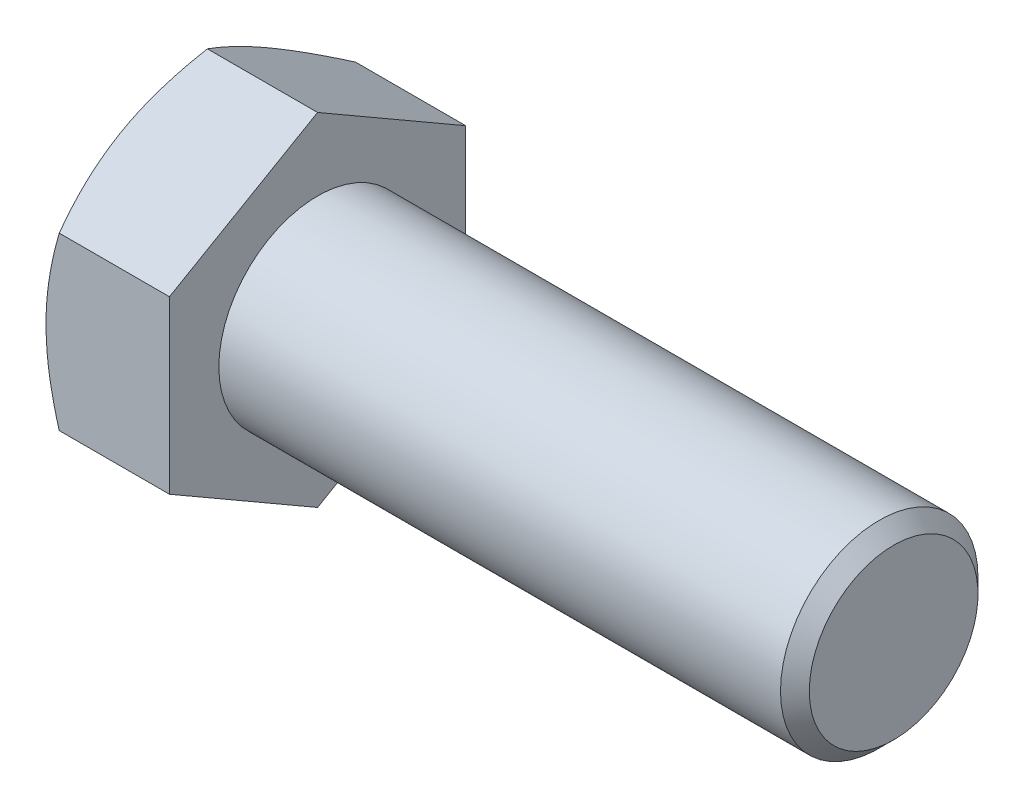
ISO-10303-21;
HEADER;
FILE_DESCRIPTION(('STEP AP214'),'2;1');
FILE_NAME('part.step','',(''),(''),'','','');
FILE_SCHEMA(('AUTOMOTIVE_DESIGN { 1 0 10303 214 1 1 1 1 }'));
ENDSEC;
DATA;
#1=APPLICATION_CONTEXT('core data for automotive mechanical design processes');
#2=APPLICATION_PROTOCOL_DEFINITION('international standard','automotive_design',2000,#1);
#3=PRODUCT_CONTEXT('',#1,'mechanical');
#4=PRODUCT('Part','Part','',(#3));
#5=PRODUCT_RELATED_PRODUCT_CATEGORY('part','',(#4));
#6=PRODUCT_DEFINITION_FORMATION('','',#4);
#7=PRODUCT_DEFINITION_CONTEXT('part definition',#1,'design');
#8=PRODUCT_DEFINITION('design','',#6,#7);
#9=PRODUCT_DEFINITION_SHAPE('','',#8);
#10=(LENGTH_UNIT() NAMED_UNIT(*) SI_UNIT(.MILLI.,.METRE.));
#11=(NAMED_UNIT(*) PLANE_ANGLE_UNIT() SI_UNIT($,.RADIAN.));
#12=(NAMED_UNIT(*) SI_UNIT($,.STERADIAN.) SOLID_ANGLE_UNIT());
#13=UNCERTAINTY_MEASURE_WITH_UNIT(LENGTH_MEASURE(1.E-05),#10,'distance_accuracy_value','');
#14=(GEOMETRIC_REPRESENTATION_CONTEXT(3) GLOBAL_UNCERTAINTY_ASSIGNED_CONTEXT((#13)) GLOBAL_UNIT_ASSIGNED_CONTEXT((#10,
#11,#12)) REPRESENTATION_CONTEXT('',''));
#15=CARTESIAN_POINT('',(0.,0.,0.));
#16=DIRECTION('',(0.,0.,1.));
#17=DIRECTION('',(1.,0.,0.));
#18=AXIS2_PLACEMENT_3D('',#15,#16,#17);
#19=CARTESIAN_POINT('',(35.,-2.42861286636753E-13,1.38777878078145E-13));
#20=DIRECTION('',(-0.999999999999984,0.,0.));
#21=DIRECTION('',(0.,0.,0.999999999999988));
#22=AXIS2_PLACEMENT_3D('',#19,#20,#21);
#23=CYLINDRICAL_SURFACE('',#22,6.);
#24=CARTESIAN_POINT('',(34.125,-1.80411241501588E-13,3.60822483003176E-13));
#25=DIRECTION('',(0.999999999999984,0.,0.));
#26=DIRECTION('',(0.,0.,-0.999999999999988));
#27=AXIS2_PLACEMENT_3D('',#24,#25,#26);
#28=CIRCLE('',#27,6.);
#29=CARTESIAN_POINT('',(34.125,-2.26207941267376E-13,6.00000000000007));
#30=VERTEX_POINT('',#29);
#31=EDGE_CURVE('E11',#30,#30,#28,.F.);
#32=CARTESIAN_POINT('',(0.,0.,0.));
#33=DIRECTION('',(-0.999999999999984,0.,0.));
#34=DIRECTION('',(0.,0.,0.999999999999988));
#35=AXIS2_PLACEMENT_3D('',#32,#33,#34);
#36=CIRCLE('',#35,6.);
#37=CARTESIAN_POINT('',(0.,-2.26207941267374E-13,6.00000000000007));
#38=VERTEX_POINT('',#37);
#39=EDGE_CURVE('E209',#38,#38,#36,.T.);
#40=CARTESIAN_POINT('',(34.125,-2.26207941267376E-13,6.00000000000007));
#41=CARTESIAN_POINT('',(33.76953125,-2.26207941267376E-13,6.00000000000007));
#42=CARTESIAN_POINT('',(33.4140625,-2.26207941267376E-13,6.00000000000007));
#43=CARTESIAN_POINT('',(32.703125,-2.26207941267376E-13,6.00000000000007));
#44=CARTESIAN_POINT('',(32.34765625,-2.26207941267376E-13,6.00000000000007));
#45=CARTESIAN_POINT('',(31.63671875,-2.26207941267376E-13,6.00000000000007));
#46=CARTESIAN_POINT('',(31.28125,-2.26207941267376E-13,6.00000000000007));
#47=CARTESIAN_POINT('',(30.5703125,-2.26207941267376E-13,6.00000000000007));
#48=CARTESIAN_POINT('',(30.21484375,-2.26207941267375E-13,6.00000000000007));
#49=CARTESIAN_POINT('',(29.50390625,-2.26207941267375E-13,6.00000000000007));
#50=CARTESIAN_POINT('',(29.1484375,-2.26207941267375E-13,6.00000000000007));
#51=CARTESIAN_POINT('',(28.4375,-2.26207941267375E-13,6.00000000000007));
#52=CARTESIAN_POINT('',(28.08203125,-2.26207941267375E-13,6.00000000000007));
#53=CARTESIAN_POINT('',(27.37109375,-2.26207941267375E-13,6.00000000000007));
#54=CARTESIAN_POINT('',(27.015625,-2.26207941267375E-13,6.00000000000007));
#55=CARTESIAN_POINT('',(26.3046875,-2.26207941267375E-13,6.00000000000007));
#56=CARTESIAN_POINT('',(25.94921875,-2.26207941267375E-13,6.00000000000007));
#57=CARTESIAN_POINT('',(25.23828125,-2.26207941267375E-13,6.00000000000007));
#58=CARTESIAN_POINT('',(24.8828125,-2.26207941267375E-13,6.00000000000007));
#59=CARTESIAN_POINT('',(24.171875,-2.26207941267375E-13,6.00000000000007));
#60=CARTESIAN_POINT('',(23.81640625,-2.26207941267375E-13,6.00000000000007));
#61=CARTESIAN_POINT('',(23.10546875,-2.26207941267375E-13,6.00000000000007));
#62=CARTESIAN_POINT('',(22.75,-2.26207941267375E-13,6.00000000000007));
#63=CARTESIAN_POINT('',(22.0390625,-2.26207941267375E-13,6.00000000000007));
#64=CARTESIAN_POINT('',(21.68359375,-2.26207941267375E-13,6.00000000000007));
#65=CARTESIAN_POINT('',(20.97265625,-2.26207941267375E-13,6.00000000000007));
#66=CARTESIAN_POINT('',(20.6171875,-2.26207941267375E-13,6.00000000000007));
#67=CARTESIAN_POINT('',(19.90625,-2.26207941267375E-13,6.00000000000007));
#68=CARTESIAN_POINT('',(19.55078125,-2.26207941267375E-13,6.00000000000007));
#69=CARTESIAN_POINT('',(18.83984375,-2.26207941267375E-13,6.00000000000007));
#70=CARTESIAN_POINT('',(18.484375,-2.26207941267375E-13,6.00000000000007));
#71=CARTESIAN_POINT('',(17.7734375,-2.26207941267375E-13,6.00000000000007));
#72=CARTESIAN_POINT('',(17.41796875,-2.26207941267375E-13,6.00000000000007));
#73=CARTESIAN_POINT('',(16.70703125,-2.26207941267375E-13,6.00000000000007));
#74=CARTESIAN_POINT('',(16.3515625,-2.26207941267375E-13,6.00000000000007));
#75=CARTESIAN_POINT('',(15.640625,-2.26207941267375E-13,6.00000000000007));
#76=CARTESIAN_POINT('',(15.28515625,-2.26207941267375E-13,6.00000000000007));
#77=CARTESIAN_POINT('',(14.57421875,-2.26207941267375E-13,6.00000000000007));
#78=CARTESIAN_POINT('',(14.21875,-2.26207941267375E-13,6.00000000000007));
#79=CARTESIAN_POINT('',(13.5078125,-2.26207941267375E-13,6.00000000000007));
#80=CARTESIAN_POINT('',(13.15234375,-2.26207941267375E-13,6.00000000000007));
#81=CARTESIAN_POINT('',(12.44140625,-2.26207941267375E-13,6.00000000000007));
#82=CARTESIAN_POINT('',(12.0859375,-2.26207941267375E-13,6.00000000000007));
#83=CARTESIAN_POINT('',(11.375,-2.26207941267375E-13,6.00000000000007));
#84=CARTESIAN_POINT('',(11.01953125,-2.26207941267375E-13,6.00000000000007));
#85=CARTESIAN_POINT('',(10.30859375,-2.26207941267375E-13,6.00000000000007));
#86=CARTESIAN_POINT('',(9.95312499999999,-2.26207941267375E-13,6.00000000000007));
#87=CARTESIAN_POINT('',(9.24218749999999,-2.26207941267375E-13,6.00000000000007));
#88=CARTESIAN_POINT('',(8.88671874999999,-2.26207941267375E-13,6.00000000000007));
#89=CARTESIAN_POINT('',(8.17578124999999,-2.26207941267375E-13,6.00000000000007));
#90=CARTESIAN_POINT('',(7.82031249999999,-2.26207941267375E-13,6.00000000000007));
#91=CARTESIAN_POINT('',(7.10937499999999,-2.26207941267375E-13,6.00000000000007));
#92=CARTESIAN_POINT('',(6.75390624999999,-2.26207941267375E-13,6.00000000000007));
#93=CARTESIAN_POINT('',(6.04296874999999,-2.26207941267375E-13,6.00000000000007));
#94=CARTESIAN_POINT('',(5.68749999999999,-2.26207941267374E-13,6.00000000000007));
#95=CARTESIAN_POINT('',(4.97656249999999,-2.26207941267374E-13,6.00000000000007));
#96=CARTESIAN_POINT('',(4.62109374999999,-2.26207941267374E-13,6.00000000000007));
#97=CARTESIAN_POINT('',(3.91015624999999,-2.26207941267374E-13,6.00000000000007));
#98=CARTESIAN_POINT('',(3.55468749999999,-2.26207941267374E-13,6.00000000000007));
#99=CARTESIAN_POINT('',(2.84374999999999,-2.26207941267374E-13,6.00000000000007));
#100=CARTESIAN_POINT('',(2.48828124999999,-2.26207941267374E-13,6.00000000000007));
#101=CARTESIAN_POINT('',(1.77734374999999,-2.26207941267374E-13,6.00000000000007));
#102=CARTESIAN_POINT('',(1.42187499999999,-2.26207941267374E-13,6.00000000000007));
#103=CARTESIAN_POINT('',(0.710937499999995,-2.26207941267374E-13,6.00000000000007));
#104=CARTESIAN_POINT('',(0.355468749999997,-2.26207941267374E-13,6.00000000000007));
#105=CARTESIAN_POINT('',(0.,-2.26207941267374E-13,6.00000000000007));
#106=B_SPLINE_CURVE_WITH_KNOTS('',3,(#40,#41,#42,#43,#44,#45,#46,#47,#48,#49,#50,#51,#52,#53,
#54,#55,#56,#57,#58,#59,#60,#61,#62,#63,#64,#65,#66,#67,#68,#69,#70,#71,#72,#73,#74,#75,#76,#77,
#78,#79,#80,#81,#82,#83,#84,#85,#86,#87,#88,#89,#90,#91,#92,#93,#94,#95,#96,#97,#98,#99,#100,
#101,#102,#103,#104,#105),.UNSPECIFIED.,.F.,.F.,(4,2,2,2,2,2,2,2,2,2,2,2,2,2,2,2,2,2,2,2,2,2,2,
2,2,2,2,2,2,2,2,2,4),(0.,1.06640625,2.1328125,3.19921875,4.26562499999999,5.33203124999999,
6.3984375,7.46484374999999,8.53125,9.59765625,10.6640625,11.73046875,12.796875,13.86328125,
14.9296875,15.99609375,17.0625,18.12890625,19.1953125,20.26171875,21.328125,22.39453125,
23.4609375,24.52734375,25.59375,26.66015625,27.7265625,28.79296875,29.859375,30.92578125,
31.9921875,33.05859375,34.125),.UNSPECIFIED.);
#107=EDGE_CURVE('BSEAM35',#30,#38,#106,.T.);
#108=ORIENTED_EDGE('',*,*,#31,.T.);
#109=ORIENTED_EDGE('',*,*,#39,.F.);
#110=ORIENTED_EDGE('',*,*,#107,.T.);
#111=ORIENTED_EDGE('',*,*,#107,.F.);
#112=EDGE_LOOP('',(#108,#110,#109,#111));
#113=FACE_BOUND('',#112,.T.);
#114=ADVANCED_FACE('F35',(#113),#23,.T.);
#115=CARTESIAN_POINT('',(35.,-2.42861286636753E-13,1.38777878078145E-13));
#116=DIRECTION('',(0.999999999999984,0.,0.));
#117=DIRECTION('',(0.,0.,-0.999999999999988));
#118=AXIS2_PLACEMENT_3D('',#115,#116,#117);
#119=PLANE('',#118);
#120=CARTESIAN_POINT('',(35.,-2.42861286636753E-13,1.38777878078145E-13));
#121=DIRECTION('',(0.999999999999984,0.,0.));
#122=DIRECTION('',(0.,0.,-0.999999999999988));
#123=AXIS2_PLACEMENT_3D('',#120,#121,#122);
#124=CIRCLE('',#123,5.12499999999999);
#125=CARTESIAN_POINT('',(35.,-2.28636554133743E-13,5.12500000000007));
#126=VERTEX_POINT('',#125);
#127=EDGE_CURVE('E42',#126,#126,#124,.T.);
#128=ORIENTED_EDGE('',*,*,#127,.T.);
#129=EDGE_LOOP('',(#128));
#130=FACE_BOUND('',#129,.T.);
#131=ADVANCED_FACE('F195',(#130),#119,.T.);
#132=CARTESIAN_POINT('',(0.,-10.3923048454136,1.66533453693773E-13));
#133=DIRECTION('',(-0.999999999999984,0.,0.));
#134=DIRECTION('',(0.,0.,0.999999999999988));
#135=AXIS2_PLACEMENT_3D('',#132,#133,#134);
#136=PLANE('',#135);
#137=DIRECTION('',(0.,0.500000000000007,0.86602540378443));
#138=VECTOR('',#137,1.);
#139=CARTESIAN_POINT('',(0.,-10.3923048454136,1.66533453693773E-13));
#140=LINE('',#139,#138);
#141=CARTESIAN_POINT('',(0.,-10.3923048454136,1.66533453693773E-13));
#142=VERTEX_POINT('',#141);
#143=CARTESIAN_POINT('',(6.66133814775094E-13,-5.19615242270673,9.00000000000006));
#144=VERTEX_POINT('',#143);
#145=EDGE_CURVE('E236',#142,#144,#140,.T.);
#146=ORIENTED_EDGE('',*,*,#145,.F.);
#147=DIRECTION('',(0.,0.500000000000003,-0.866025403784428));
#148=VECTOR('',#147,1.);
#149=CARTESIAN_POINT('',(0.,-10.3923048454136,1.66533453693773E-13));
#150=LINE('',#149,#148);
#151=CARTESIAN_POINT('',(6.66133814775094E-13,-5.1961524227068,-8.99999999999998));
#152=VERTEX_POINT('',#151);
#153=EDGE_CURVE('E223',#142,#152,#150,.T.);
#154=ORIENTED_EDGE('',*,*,#153,.T.);
#155=DIRECTION('',(0.,1.00000000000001,0.));
#156=VECTOR('',#155,1.);
#157=CARTESIAN_POINT('',(6.66133814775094E-13,-5.1961524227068,-8.99999999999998));
#158=LINE('',#157,#156);
#159=CARTESIAN_POINT('',(-2.22044604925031E-13,5.19615242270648,-8.99999999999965));
#160=VERTEX_POINT('',#159);
#161=EDGE_CURVE('E226',#152,#160,#158,.T.);
#162=ORIENTED_EDGE('',*,*,#161,.T.);
#163=DIRECTION('',(0.,0.500000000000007,0.866025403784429));
#164=VECTOR('',#163,1.);
#165=CARTESIAN_POINT('',(-2.22044604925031E-13,5.19615242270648,-8.99999999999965));
#166=LINE('',#165,#164);
#167=CARTESIAN_POINT('',(0.,10.3923048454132,0.));
#168=VERTEX_POINT('',#167);
#169=EDGE_CURVE('E229',#160,#168,#166,.T.);
#170=ORIENTED_EDGE('',*,*,#169,.T.);
#171=DIRECTION('',(0.,0.500000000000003,-0.866025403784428));
#172=VECTOR('',#171,1.);
#173=CARTESIAN_POINT('',(-3.88578058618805E-13,5.19615242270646,8.99999999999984));
#174=LINE('',#173,#172);
#175=CARTESIAN_POINT('',(-3.88578058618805E-13,5.19615242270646,8.99999999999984));
#176=VERTEX_POINT('',#175);
#177=EDGE_CURVE('E232',#176,#168,#174,.T.);
#178=ORIENTED_EDGE('',*,*,#177,.F.);
#179=DIRECTION('',(0.,1.00000000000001,0.));
#180=VECTOR('',#179,1.);
#181=CARTESIAN_POINT('',(6.66133814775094E-13,-5.19615242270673,9.00000000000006));
#182=LINE('',#181,#180);
#183=EDGE_CURVE('E234',#144,#176,#182,.T.);
#184=ORIENTED_EDGE('',*,*,#183,.F.);
#185=EDGE_LOOP('',(#146,#154,#162,#170,#178,#184));
#186=FACE_BOUND('',#185,.T.);
#187=ORIENTED_EDGE('',*,*,#39,.T.);
#188=EDGE_LOOP('',(#187));
#189=FACE_BOUND('',#188,.T.);
#190=ADVANCED_FACE('F166',(#186,#189),#136,.F.);
#191=CARTESIAN_POINT('',(-7.50000000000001,-10.3923048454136,1.94289029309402E-13));
#192=DIRECTION('',(0.,0.866025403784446,-0.499999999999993));
#193=DIRECTION('',(0.,0.500000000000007,0.86602540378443));
#194=AXIS2_PLACEMENT_3D('',#191,#192,#193);
#195=PLANE('',#194);
#196=CARTESIAN_POINT('',(-6.69608575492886,-10.3924203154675,-0.000200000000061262));
#197=CARTESIAN_POINT('',(-6.76201799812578,-10.2782163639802,0.197607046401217));
#198=CARTESIAN_POINT('',(-6.82495859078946,-10.1635669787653,0.39618560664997));
#199=CARTESIAN_POINT('',(-6.94403100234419,-9.93333715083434,0.794955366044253));
#200=CARTESIAN_POINT('',(-7.00015988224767,-9.81775632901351,0.995147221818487));
#201=CARTESIAN_POINT('',(-7.10484803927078,-9.58544915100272,1.39751505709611));
#202=CARTESIAN_POINT('',(-7.15338922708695,-9.46872074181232,1.5996945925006));
#203=CARTESIAN_POINT('',(-7.2418514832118,-9.23447001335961,2.00542875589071));
#204=CARTESIAN_POINT('',(-7.28177431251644,-9.11694786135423,2.20898309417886));
#205=CARTESIAN_POINT('',(-7.35131532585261,-8.88408932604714,2.61230590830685));
#206=CARTESIAN_POINT('',(-7.38116249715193,-8.768770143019,2.81204459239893));
#207=CARTESIAN_POINT('',(-7.43120669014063,-8.53761579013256,3.2124156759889));
#208=CARTESIAN_POINT('',(-7.45140456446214,-8.42178066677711,3.4130479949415));
#209=CARTESIAN_POINT('',(-7.48164565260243,-8.18990950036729,3.81466063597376));
#210=CARTESIAN_POINT('',(-7.4917003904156,-8.07387383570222,4.01564030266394));
#211=CARTESIAN_POINT('',(-7.50143766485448,-7.84169571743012,4.41778459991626));
#212=CARTESIAN_POINT('',(-7.50112052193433,-7.72555326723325,4.61894922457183));
#213=CARTESIAN_POINT('',(-7.49083604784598,-7.50842142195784,4.99503261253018));
#214=CARTESIAN_POINT('',(-7.48212325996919,-7.40741671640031,5.16997789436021));
#215=CARTESIAN_POINT('',(-7.45702265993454,-7.20564389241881,5.51945867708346));
#216=CARTESIAN_POINT('',(-7.44063433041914,-7.10487579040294,5.69399414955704));
#217=CARTESIAN_POINT('',(-7.38034344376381,-6.80296159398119,6.21692487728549));
#218=CARTESIAN_POINT('',(-7.32532251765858,-6.60234990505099,6.56439451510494));
#219=CARTESIAN_POINT('',(-7.18776952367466,-6.19899850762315,7.26301962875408));
#220=CARTESIAN_POINT('',(-7.10465438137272,-5.99631027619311,7.61408594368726));
#221=CARTESIAN_POINT('',(-6.91601746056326,-5.5939563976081,8.3109833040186));
#222=CARTESIAN_POINT('',(-6.81053998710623,-5.39428559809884,8.65682327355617));
#223=CARTESIAN_POINT('',(-6.69608575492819,-5.19603695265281,9.00019999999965));
#224=B_SPLINE_CURVE_WITH_KNOTS('',3,(#196,#197,#198,#199,#200,#201,#202,#203,#204,#205,#206,
#207,#208,#209,#210,#211,#212,#213,#214,#215,#216,#217,#218,#219,#220,#221,#222,#223),
.UNSPECIFIED.,.F.,.F.,(4,2,2,2,2,2,2,2,2,2,2,2,2,4),(0.,0.713219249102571,1.42674513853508,
2.14194697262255,2.85700253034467,3.55449749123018,4.25193080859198,4.94857085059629,
5.64518936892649,6.25162976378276,6.85811104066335,8.0719374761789,9.31268391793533,
10.5509947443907),.UNSPECIFIED.);
#225=CARTESIAN_POINT('',(-6.6961524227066,-10.3923048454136,1.66533453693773E-13));
#226=VERTEX_POINT('',#225);
#227=CARTESIAN_POINT('',(-7.49999999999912,-7.79422863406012,4.49999999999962));
#228=VERTEX_POINT('',#227);
#229=EDGE_CURVE('E183',#226,#228,#224,.T.);
#230=ORIENTED_EDGE('',*,*,#229,.F.);
#231=DIRECTION('',(0.999999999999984,0.,0.));
#232=VECTOR('',#231,1.);
#233=CARTESIAN_POINT('',(-7.50000000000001,-10.3923048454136,1.94289029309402E-13));
#234=LINE('',#233,#232);
#235=EDGE_CURVE('E221',#226,#142,#234,.T.);
#236=ORIENTED_EDGE('',*,*,#235,.T.);
#237=ORIENTED_EDGE('',*,*,#145,.T.);
#238=DIRECTION('',(0.999999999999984,0.,0.));
#239=VECTOR('',#238,1.);
#240=CARTESIAN_POINT('',(-7.49999999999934,-5.19615242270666,8.99999999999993));
#241=LINE('',#240,#239);
#242=CARTESIAN_POINT('',(-6.69615242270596,-5.19615242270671,8.99999999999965));
#243=VERTEX_POINT('',#242);
#244=EDGE_CURVE('E212',#243,#144,#241,.T.);
#245=ORIENTED_EDGE('',*,*,#244,.F.);
#246=EDGE_CURVE('E137',#228,#243,#224,.T.);
#247=ORIENTED_EDGE('',*,*,#246,.F.);
#248=EDGE_LOOP('',(#230,#236,#237,#245,#247));
#249=FACE_BOUND('',#248,.T.);
#250=ADVANCED_FACE('F189',(#249),#195,.F.);
#251=CARTESIAN_POINT('',(-7.49999999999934,-5.19615242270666,8.99999999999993));
#252=DIRECTION('',(0.,0.,-0.999999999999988));
#253=DIRECTION('',(-0.999999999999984,0.,0.));
#254=AXIS2_PLACEMENT_3D('',#251,#252,#253);
#255=PLANE('',#254);
#256=CARTESIAN_POINT('',(-2.992817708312,-14.1938054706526,9.00000000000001));
#257=CARTESIAN_POINT('',(-3.18545400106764,-13.7986249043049,8.99999999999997));
#258=CARTESIAN_POINT('',(-3.37631016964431,-13.4025620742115,8.99999999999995));
#259=CARTESIAN_POINT('',(-3.75346543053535,-12.6082034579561,8.99999999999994));
#260=CARTESIAN_POINT('',(-3.93976384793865,-12.2099073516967,8.99999999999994));
#261=CARTESIAN_POINT('',(-4.30769386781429,-11.4086732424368,8.99999999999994));
#262=CARTESIAN_POINT('',(-4.48929651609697,-11.0057218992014,8.99999999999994));
#263=CARTESIAN_POINT('',(-4.84537774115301,-10.1966954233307,8.99999999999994));
#264=CARTESIAN_POINT('',(-5.01985663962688,-9.7906204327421,8.99999999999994));
#265=CARTESIAN_POINT('',(-5.36560228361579,-8.96081603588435,8.99999999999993));
#266=CARTESIAN_POINT('',(-5.53655757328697,-8.53695616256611,8.99999999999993));
#267=CARTESIAN_POINT('',(-5.86609252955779,-7.68436682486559,8.99999999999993));
#268=CARTESIAN_POINT('',(-6.02467084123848,-7.25563683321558,8.99999999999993));
#269=CARTESIAN_POINT('',(-6.32546141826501,-6.393348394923,8.99999999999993));
#270=CARTESIAN_POINT('',(-6.46770484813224,-5.95980093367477,8.99999999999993));
#271=CARTESIAN_POINT('',(-6.73142002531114,-5.08650675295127,8.99999999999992));
#272=CARTESIAN_POINT('',(-6.85289806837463,-4.64676195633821,8.9999999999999));
#273=CARTESIAN_POINT('',(-7.06875933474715,-3.76318857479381,8.9999999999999));
#274=CARTESIAN_POINT('',(-7.16329494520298,-3.31939822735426,8.99999999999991));
#275=CARTESIAN_POINT('',(-7.28091249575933,-2.64948950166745,8.99999999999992));
#276=CARTESIAN_POINT('',(-7.31608884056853,-2.42546830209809,8.99999999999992));
#277=CARTESIAN_POINT('',(-7.37769613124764,-1.97623392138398,8.99999999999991));
#278=CARTESIAN_POINT('',(-7.40412792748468,-1.75102085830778,8.99999999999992));
#279=CARTESIAN_POINT('',(-7.44737513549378,-1.30274989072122,8.99999999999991));
#280=CARTESIAN_POINT('',(-7.46431601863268,-1.0797041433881,8.99999999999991));
#281=CARTESIAN_POINT('',(-7.48874105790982,-0.633095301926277,8.99999999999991));
#282=CARTESIAN_POINT('',(-7.49622537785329,-0.409532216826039,8.99999999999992));
#283=CARTESIAN_POINT('',(-7.5015576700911,0.037712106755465,8.9999999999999));
#284=CARTESIAN_POINT('',(-7.49940559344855,0.261393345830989,8.99999999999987));
#285=CARTESIAN_POINT('',(-7.48552018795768,0.708460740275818,8.99999999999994));
#286=CARTESIAN_POINT('',(-7.47378642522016,0.931846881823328,9.00000000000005));
#287=CARTESIAN_POINT('',(-7.43485039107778,1.46162752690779,9.00000000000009));
#288=CARTESIAN_POINT('',(-7.40349650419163,1.76772399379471,8.99999999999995));
#289=CARTESIAN_POINT('',(-7.3244559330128,2.37778404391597,8.99999999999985));
#290=CARTESIAN_POINT('',(-7.27676722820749,2.68174735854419,8.99999999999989));
#291=CARTESIAN_POINT('',(-7.11171638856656,3.59000335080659,8.99999999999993));
#292=CARTESIAN_POINT('',(-6.97239428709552,4.19036603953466,8.9999999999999));
#293=CARTESIAN_POINT('',(-6.72898039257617,5.08858153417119,8.99999999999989));
#294=CARTESIAN_POINT('',(-6.64089135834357,5.39104017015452,8.9999999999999));
#295=CARTESIAN_POINT('',(-6.45511431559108,5.99302412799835,8.9999999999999));
#296=CARTESIAN_POINT('',(-6.35742623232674,6.29254942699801,8.99999999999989));
#297=CARTESIAN_POINT('',(-6.15405553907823,6.8887558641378,8.99999999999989));
#298=CARTESIAN_POINT('',(-6.0483751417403,7.18543776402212,8.99999999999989));
#299=CARTESIAN_POINT('',(-5.83030807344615,7.77631041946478,8.99999999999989));
#300=CARTESIAN_POINT('',(-5.71792156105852,8.07050123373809,8.9999999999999));
#301=CARTESIAN_POINT('',(-5.40462740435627,8.86768097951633,8.9999999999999));
#302=CARTESIAN_POINT('',(-5.19823951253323,9.36851420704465,8.99999999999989));
#303=CARTESIAN_POINT('',(-4.77318997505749,10.3649647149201,8.99999999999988));
#304=CARTESIAN_POINT('',(-4.5545269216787,10.8605813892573,8.99999999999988));
#305=CARTESIAN_POINT('',(-4.10785524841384,11.8478077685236,8.99999999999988));
#306=CARTESIAN_POINT('',(-3.87984295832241,12.339415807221,8.99999999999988));
#307=CARTESIAN_POINT('',(-3.41672758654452,13.3192435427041,8.99999999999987));
#308=CARTESIAN_POINT('',(-3.18162480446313,13.807463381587,8.99999999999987));
#309=CARTESIAN_POINT('',(-2.70549247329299,14.7819931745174,8.99999999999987));
#310=CARTESIAN_POINT('',(-2.46445381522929,15.2682986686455,8.99999999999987));
#311=CARTESIAN_POINT('',(-1.97797920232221,16.2387067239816,8.99999999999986));
#312=CARTESIAN_POINT('',(-1.7325432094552,16.7228092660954,8.99999999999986));
#313=CARTESIAN_POINT('',(-1.23819989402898,17.6890969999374,8.99999999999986));
#314=CARTESIAN_POINT('',(-0.989293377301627,18.1712826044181,8.99999999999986));
#315=CARTESIAN_POINT('',(-0.48860773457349,19.1341609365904,8.99999999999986));
#316=CARTESIAN_POINT('',(-0.236828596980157,19.6148536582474,8.99999999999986));
#317=CARTESIAN_POINT('',(0.467839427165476,20.9522159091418,8.99999999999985));
#318=CARTESIAN_POINT('',(0.923301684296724,21.8075292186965,8.99999999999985));
#319=CARTESIAN_POINT('',(1.83966951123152,23.5152984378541,8.99999999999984));
#320=CARTESIAN_POINT('',(2.30057542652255,24.3677541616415,8.99999999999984));
#321=CARTESIAN_POINT('',(3.22485857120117,26.0675482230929,8.99999999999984));
#322=CARTESIAN_POINT('',(3.68822195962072,26.914894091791,8.99999999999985));
#323=CARTESIAN_POINT('',(4.38556367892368,28.184605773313,8.99999999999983));
#324=CARTESIAN_POINT('',(4.61838432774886,28.6076082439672,8.99999999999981));
#325=CARTESIAN_POINT('',(5.08471147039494,29.4532343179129,8.99999999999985));
#326=CARTESIAN_POINT('',(5.31821796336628,29.875857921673,8.99999999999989));
#327=CARTESIAN_POINT('',(5.55202477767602,30.2983153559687,9.00000000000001));
#328=B_SPLINE_CURVE_WITH_KNOTS('',3,(#256,#257,#258,#259,#260,#261,#262,#263,#264,#265,#266,
#267,#268,#269,#270,#271,#272,#273,#274,#275,#276,#277,#278,#279,#280,#281,#282,#283,#284,#285,
#286,#287,#288,#289,#290,#291,#292,#293,#294,#295,#296,#297,#298,#299,#300,#301,#302,#303,#304,
#305,#306,#307,#308,#309,#310,#311,#312,#313,#314,#315,#316,#317,#318,#319,#320,#321,#322,#323,
#324,#325,#326,#327),.UNSPECIFIED.,.F.,.F.,(4,2,2,2,2,2,2,2,2,2,2,2,2,2,2,2,2,2,2,2,2,2,2,2,2,2,
2,2,2,2,2,2,2,2,2,4),(0.,1.31891143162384,2.63801699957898,3.96391175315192,5.28974656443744,
6.66070766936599,8.03181864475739,9.40026868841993,10.7683030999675,12.128438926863,
12.8085936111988,13.4886821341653,14.1595537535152,14.8304137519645,15.5012771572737,
16.1721709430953,17.0947490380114,18.0174412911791,19.8637129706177,20.8087031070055,
21.7537006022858,22.6984374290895,23.6431519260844,25.2679809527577,26.8929966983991,
28.5186565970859,30.144247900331,31.7725119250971,33.4007900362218,35.0286961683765,
36.6566088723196,39.5636489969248,42.4708746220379,45.3681585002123,46.816684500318,
48.2652087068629),.UNSPECIFIED.);
#329=CARTESIAN_POINT('',(-7.50000000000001,0.,9.00000000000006));
#330=VERTEX_POINT('',#329);
#331=EDGE_CURVE('E238',#243,#330,#328,.T.);
#332=ORIENTED_EDGE('',*,*,#331,.F.);
#333=ORIENTED_EDGE('',*,*,#244,.T.);
#334=ORIENTED_EDGE('',*,*,#183,.T.);
#335=DIRECTION('',(0.999999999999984,0.,0.));
#336=VECTOR('',#335,1.);
#337=CARTESIAN_POINT('',(-7.50000000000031,5.1961524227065,8.99999999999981));
#338=LINE('',#337,#336);
#339=CARTESIAN_POINT('',(-6.69615242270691,5.19615242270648,8.99999999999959));
#340=VERTEX_POINT('',#339);
#341=EDGE_CURVE('E214',#340,#176,#338,.T.);
#342=ORIENTED_EDGE('',*,*,#341,.F.);
#343=EDGE_CURVE('E108',#330,#340,#328,.T.);
#344=ORIENTED_EDGE('',*,*,#343,.F.);
#345=EDGE_LOOP('',(#332,#333,#334,#342,#344));
#346=FACE_BOUND('',#345,.T.);
#347=ADVANCED_FACE('F192',(#346),#255,.F.);
#348=CARTESIAN_POINT('',(-7.50000000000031,5.1961524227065,8.99999999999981));
#349=DIRECTION('',(0.,-0.866025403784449,-0.499999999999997));
#350=DIRECTION('',(0.,0.500000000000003,-0.866025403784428));
#351=AXIS2_PLACEMENT_3D('',#348,#349,#350);
#352=PLANE('',#351);
#353=CARTESIAN_POINT('',(-6.69608575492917,5.19603695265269,9.00019999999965));
#354=CARTESIAN_POINT('',(-6.76201799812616,5.31024090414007,8.80239295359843));
#355=CARTESIAN_POINT('',(-6.82495859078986,5.42489028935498,8.6038143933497));
#356=CARTESIAN_POINT('',(-6.94403100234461,5.65512011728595,8.20504463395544));
#357=CARTESIAN_POINT('',(-7.00015988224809,5.77070093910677,8.0048527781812));
#358=CARTESIAN_POINT('',(-7.1048480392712,6.00300811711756,7.60248494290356));
#359=CARTESIAN_POINT('',(-7.15338922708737,6.11973652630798,7.40030540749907));
#360=CARTESIAN_POINT('',(-7.24185148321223,6.3539872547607,6.99457124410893));
#361=CARTESIAN_POINT('',(-7.28177431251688,6.47150940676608,6.79101690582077));
#362=CARTESIAN_POINT('',(-7.35131532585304,6.70436794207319,6.38769409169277));
#363=CARTESIAN_POINT('',(-7.38116249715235,6.81968712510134,6.18795540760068));
#364=CARTESIAN_POINT('',(-7.43120669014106,7.05084147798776,5.7875843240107));
#365=CARTESIAN_POINT('',(-7.45140456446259,7.16667660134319,5.58695200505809));
#366=CARTESIAN_POINT('',(-7.48164565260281,7.39854776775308,5.18533936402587));
#367=CARTESIAN_POINT('',(-7.4917003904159,7.51458343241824,4.98435969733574));
#368=CARTESIAN_POINT('',(-7.501437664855,7.74676155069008,4.58221540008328));
#369=CARTESIAN_POINT('',(-7.50112052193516,7.86290400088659,4.38105077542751));
#370=CARTESIAN_POINT('',(-7.49083604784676,8.08003584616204,4.00496738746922));
#371=CARTESIAN_POINT('',(-7.48212325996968,8.18104055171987,3.8300221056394));
#372=CARTESIAN_POINT('',(-7.45702265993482,8.38281337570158,3.48054132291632));
#373=CARTESIAN_POINT('',(-7.44063433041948,8.48358147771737,3.30600585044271));
#374=CARTESIAN_POINT('',(-7.38034344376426,8.78549567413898,2.78307512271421));
#375=CARTESIAN_POINT('',(-7.32532251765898,8.98610736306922,2.43560548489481));
#376=CARTESIAN_POINT('',(-7.18776952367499,9.38945876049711,1.73698037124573));
#377=CARTESIAN_POINT('',(-7.10465438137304,9.59214699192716,1.38591405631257));
#378=CARTESIAN_POINT('',(-6.91601746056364,9.99450087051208,0.6890166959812));
#379=CARTESIAN_POINT('',(-6.81053998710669,10.1941716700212,0.343176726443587));
#380=CARTESIAN_POINT('',(-6.6960857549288,10.3924203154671,-0.000200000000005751));
#381=B_SPLINE_CURVE_WITH_KNOTS('',3,(#353,#354,#355,#356,#357,#358,#359,#360,#361,#362,#363,
#364,#365,#366,#367,#368,#369,#370,#371,#372,#373,#374,#375,#376,#377,#378,#379,#380),
.UNSPECIFIED.,.F.,.F.,(4,2,2,2,2,2,2,2,2,2,2,2,2,4),(0.,0.713219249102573,1.42674513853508,
2.1419469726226,2.85700253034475,3.55449749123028,4.25193080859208,4.94857085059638,
5.64518936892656,6.25162976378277,6.85811104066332,8.07193747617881,9.31268391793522,
10.5509947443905),.UNSPECIFIED.);
#382=CARTESIAN_POINT('',(-7.50000000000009,7.79422863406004,4.49999999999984));
#383=VERTEX_POINT('',#382);
#384=EDGE_CURVE('E104',#340,#383,#381,.T.);
#385=ORIENTED_EDGE('',*,*,#384,.F.);
#386=ORIENTED_EDGE('',*,*,#341,.T.);
#387=ORIENTED_EDGE('',*,*,#177,.T.);
#388=DIRECTION('',(0.999999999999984,0.,0.));
#389=VECTOR('',#388,1.);
#390=CARTESIAN_POINT('',(-7.49999999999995,10.3923048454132,-1.94289029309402E-13));
#391=LINE('',#390,#389);
#392=CARTESIAN_POINT('',(-6.69615242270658,10.3923048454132,-1.66533453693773E-13));
#393=VERTEX_POINT('',#392);
#394=EDGE_CURVE('E136',#393,#168,#391,.T.);
#395=ORIENTED_EDGE('',*,*,#394,.F.);
#396=EDGE_CURVE('E112',#383,#393,#381,.T.);
#397=ORIENTED_EDGE('',*,*,#396,.F.);
#398=EDGE_LOOP('',(#385,#386,#387,#395,#397));
#399=FACE_BOUND('',#398,.T.);
#400=ADVANCED_FACE('F134',(#399),#352,.F.);
#401=CARTESIAN_POINT('',(-7.50000000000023,5.19615242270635,-9.00000000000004));
#402=DIRECTION('',(0.,0.866025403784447,-0.499999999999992));
#403=DIRECTION('',(0.,0.500000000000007,0.866025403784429));
#404=AXIS2_PLACEMENT_3D('',#401,#402,#403);
#405=PLANE('',#404);
#406=DIRECTION('',(0.999999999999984,0.,0.));
#407=VECTOR('',#406,1.);
#408=CARTESIAN_POINT('',(-7.50000000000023,5.19615242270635,-9.00000000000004));
#409=LINE('',#408,#407);
#410=CARTESIAN_POINT('',(-6.69615242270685,5.19615242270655,-8.99999999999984));
#411=VERTEX_POINT('',#410);
#412=EDGE_CURVE('E217',#411,#160,#409,.T.);
#413=ORIENTED_EDGE('',*,*,#412,.F.);
#414=CARTESIAN_POINT('',(-6.69608575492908,5.19603695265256,-9.00019999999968));
#415=CARTESIAN_POINT('',(-6.76201799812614,5.31024090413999,-8.8023929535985));
#416=CARTESIAN_POINT('',(-6.82495859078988,5.42489028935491,-8.60381439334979));
#417=CARTESIAN_POINT('',(-6.94403100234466,5.65512011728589,-8.20504463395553));
#418=CARTESIAN_POINT('',(-7.00015988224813,5.7707009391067,-8.00485277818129));
#419=CARTESIAN_POINT('',(-7.10484803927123,6.00300811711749,-7.60248494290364));
#420=CARTESIAN_POINT('',(-7.15338922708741,6.1197365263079,-7.40030540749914));
#421=CARTESIAN_POINT('',(-7.24185148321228,6.35398725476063,-6.994571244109));
#422=CARTESIAN_POINT('',(-7.28177431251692,6.47150940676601,-6.79101690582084));
#423=CARTESIAN_POINT('',(-7.35131532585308,6.70436794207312,-6.38769409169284));
#424=CARTESIAN_POINT('',(-7.3811624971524,6.81968712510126,-6.18795540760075));
#425=CARTESIAN_POINT('',(-7.43120669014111,7.05084147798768,-5.78758432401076));
#426=CARTESIAN_POINT('',(-7.45140456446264,7.16667660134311,-5.58695200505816));
#427=CARTESIAN_POINT('',(-7.48164565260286,7.398547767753,-5.18533936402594));
#428=CARTESIAN_POINT('',(-7.49170039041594,7.51458343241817,-4.98435969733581));
#429=CARTESIAN_POINT('',(-7.50143766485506,7.74676155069,-4.58221540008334));
#430=CARTESIAN_POINT('',(-7.50112052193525,7.8629040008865,-4.38105077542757));
#431=CARTESIAN_POINT('',(-7.49083604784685,8.08003584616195,-4.00496738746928));
#432=CARTESIAN_POINT('',(-7.48212325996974,8.18104055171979,-3.83002210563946));
#433=CARTESIAN_POINT('',(-7.45702265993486,8.38281337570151,-3.48054132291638));
#434=CARTESIAN_POINT('',(-7.44063433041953,8.4835814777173,-3.30600585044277));
#435=CARTESIAN_POINT('',(-7.38034344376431,8.7854956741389,-2.78307512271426));
#436=CARTESIAN_POINT('',(-7.32532251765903,8.98610736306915,-2.43560548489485));
#437=CARTESIAN_POINT('',(-7.18776952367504,9.38945876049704,-1.73698037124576));
#438=CARTESIAN_POINT('',(-7.10465438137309,9.59214699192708,-1.38591405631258));
#439=CARTESIAN_POINT('',(-6.91601746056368,9.99450087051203,-0.689016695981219));
#440=CARTESIAN_POINT('',(-6.81053998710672,10.1941716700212,-0.343176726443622));
#441=CARTESIAN_POINT('',(-6.6960857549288,10.3924203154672,0.000199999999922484));
#442=B_SPLINE_CURVE_WITH_KNOTS('',3,(#414,#415,#416,#417,#418,#419,#420,#421,#422,#423,#424,
#425,#426,#427,#428,#429,#430,#431,#432,#433,#434,#435,#436,#437,#438,#439,#440,#441),
.UNSPECIFIED.,.F.,.F.,(4,2,2,2,2,2,2,2,2,2,2,2,2,4),(0.,0.713219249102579,1.42674513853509,
2.14194697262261,2.85700253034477,3.5544974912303,4.2519308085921,4.94857085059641,
5.64518936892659,6.2516297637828,6.85811104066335,8.07193747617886,9.31268391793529,
10.5509947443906),.UNSPECIFIED.);
#443=CARTESIAN_POINT('',(-7.50000000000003,7.79422863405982,-4.49999999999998));
#444=VERTEX_POINT('',#443);
#445=EDGE_CURVE('E139',#411,#444,#442,.T.);
#446=ORIENTED_EDGE('',*,*,#445,.T.);
#447=EDGE_CURVE('E119',#444,#393,#442,.T.);
#448=ORIENTED_EDGE('',*,*,#447,.T.);
#449=ORIENTED_EDGE('',*,*,#394,.T.);
#450=ORIENTED_EDGE('',*,*,#169,.F.);
#451=EDGE_LOOP('',(#413,#446,#448,#449,#450));
#452=FACE_BOUND('',#451,.T.);
#453=ADVANCED_FACE('F264',(#452),#405,.T.);
#454=CARTESIAN_POINT('',(-7.49999999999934,-5.19615242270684,-8.99999999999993));
#455=DIRECTION('',(0.,0.,-0.999999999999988));
#456=DIRECTION('',(-0.999999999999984,0.,0.));
#457=AXIS2_PLACEMENT_3D('',#454,#455,#456);
#458=PLANE('',#457);
#459=DIRECTION('',(0.999999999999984,0.,0.));
#460=VECTOR('',#459,1.);
#461=CARTESIAN_POINT('',(-7.49999999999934,-5.19615242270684,-8.99999999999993));
#462=LINE('',#461,#460);
#463=CARTESIAN_POINT('',(-6.69615242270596,-5.19615242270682,-8.99999999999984));
#464=VERTEX_POINT('',#463);
#465=EDGE_CURVE('E219',#464,#152,#462,.T.);
#466=ORIENTED_EDGE('',*,*,#465,.F.);
#467=CARTESIAN_POINT('',(-2.99281770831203,-14.1938054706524,-8.99999999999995));
#468=CARTESIAN_POINT('',(-3.18545400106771,-13.7986249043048,-8.99999999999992));
#469=CARTESIAN_POINT('',(-3.3763101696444,-13.4025620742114,-8.99999999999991));
#470=CARTESIAN_POINT('',(-3.75346543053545,-12.608203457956,-8.9999999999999));
#471=CARTESIAN_POINT('',(-3.93976384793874,-12.2099073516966,-8.9999999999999));
#472=CARTESIAN_POINT('',(-4.30769386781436,-11.4086732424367,-8.99999999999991));
#473=CARTESIAN_POINT('',(-4.48929651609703,-11.0057218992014,-8.99999999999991));
#474=CARTESIAN_POINT('',(-4.84537774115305,-10.1966954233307,-8.99999999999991));
#475=CARTESIAN_POINT('',(-5.01985663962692,-9.79062043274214,-8.99999999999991));
#476=CARTESIAN_POINT('',(-5.36560228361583,-8.96081603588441,-8.99999999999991));
#477=CARTESIAN_POINT('',(-5.53655757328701,-8.53695616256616,-8.99999999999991));
#478=CARTESIAN_POINT('',(-5.86609252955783,-7.68436682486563,-8.99999999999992));
#479=CARTESIAN_POINT('',(-6.02467084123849,-7.25563683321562,-8.99999999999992));
#480=CARTESIAN_POINT('',(-6.32546141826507,-6.39334839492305,-8.99999999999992));
#481=CARTESIAN_POINT('',(-6.46770484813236,-5.95980093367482,-8.99999999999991));
#482=CARTESIAN_POINT('',(-6.73142002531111,-5.08650675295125,-8.99999999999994));
#483=CARTESIAN_POINT('',(-6.8528980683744,-4.64676195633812,-8.99999999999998));
#484=CARTESIAN_POINT('',(-7.06875933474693,-3.76318857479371,-8.99999999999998));
#485=CARTESIAN_POINT('',(-7.16329494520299,-3.31939822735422,-8.99999999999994));
#486=CARTESIAN_POINT('',(-7.28091249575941,-2.64948950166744,-8.99999999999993));
#487=CARTESIAN_POINT('',(-7.31608884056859,-2.42546830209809,-8.99999999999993));
#488=CARTESIAN_POINT('',(-7.37769613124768,-1.97623392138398,-8.99999999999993));
#489=CARTESIAN_POINT('',(-7.40412792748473,-1.7510208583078,-8.99999999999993));
#490=CARTESIAN_POINT('',(-7.44737513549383,-1.30274989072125,-8.99999999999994));
#491=CARTESIAN_POINT('',(-7.46431601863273,-1.07970414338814,-8.99999999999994));
#492=CARTESIAN_POINT('',(-7.48874105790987,-0.63309530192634,-8.99999999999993));
#493=CARTESIAN_POINT('',(-7.49622537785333,-0.409532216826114,-8.99999999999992));
#494=CARTESIAN_POINT('',(-7.50155767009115,0.0377121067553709,-8.99999999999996));
#495=CARTESIAN_POINT('',(-7.49940559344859,0.261393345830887,-9.));
#496=CARTESIAN_POINT('',(-7.48552018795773,0.708460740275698,-8.99999999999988));
#497=CARTESIAN_POINT('',(-7.47378642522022,0.931846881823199,-8.99999999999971));
#498=CARTESIAN_POINT('',(-7.43485039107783,1.46162752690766,-8.99999999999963));
#499=CARTESIAN_POINT('',(-7.40349650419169,1.76772399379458,-8.99999999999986));
#500=CARTESIAN_POINT('',(-7.32445593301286,2.37778404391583,-9.00000000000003));
#501=CARTESIAN_POINT('',(-7.27676722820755,2.68174735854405,-8.99999999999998));
#502=CARTESIAN_POINT('',(-7.11171638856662,3.59000335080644,-8.99999999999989));
#503=CARTESIAN_POINT('',(-6.97239428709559,4.1903660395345,-8.99999999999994));
#504=CARTESIAN_POINT('',(-6.72898039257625,5.08858153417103,-8.99999999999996));
#505=CARTESIAN_POINT('',(-6.64089135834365,5.39104017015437,-8.99999999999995));
#506=CARTESIAN_POINT('',(-6.45511431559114,5.9930241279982,-8.99999999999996));
#507=CARTESIAN_POINT('',(-6.35742623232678,6.29254942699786,-8.99999999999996));
#508=CARTESIAN_POINT('',(-6.15405553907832,6.88875586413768,-8.99999999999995));
#509=CARTESIAN_POINT('',(-6.04837514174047,7.18543776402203,-8.99999999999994));
#510=CARTESIAN_POINT('',(-5.8303080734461,7.77631041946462,-8.99999999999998));
#511=CARTESIAN_POINT('',(-5.71792156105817,8.07050123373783,-9.00000000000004));
#512=CARTESIAN_POINT('',(-5.40462740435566,8.86768097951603,-9.0000000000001));
#513=CARTESIAN_POINT('',(-5.19823951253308,9.36851420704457,-9.));
#514=CARTESIAN_POINT('',(-4.77318997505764,10.3649647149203,-8.99999999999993));
#515=CARTESIAN_POINT('',(-4.55452692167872,10.8605813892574,-8.99999999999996));
#516=CARTESIAN_POINT('',(-4.10785524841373,11.8478077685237,-8.99999999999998));
#517=CARTESIAN_POINT('',(-3.87984295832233,12.3394158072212,-8.99999999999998));
#518=CARTESIAN_POINT('',(-3.41672758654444,13.3192435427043,-8.99999999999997));
#519=CARTESIAN_POINT('',(-3.18162480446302,13.8074633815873,-8.99999999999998));
#520=CARTESIAN_POINT('',(-2.70549247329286,14.7819931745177,-8.99999999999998));
#521=CARTESIAN_POINT('',(-2.46445381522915,15.2682986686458,-8.99999999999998));
#522=CARTESIAN_POINT('',(-1.97797920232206,16.2387067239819,-8.99999999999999));
#523=CARTESIAN_POINT('',(-1.73254320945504,16.7228092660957,-8.99999999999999));
#524=CARTESIAN_POINT('',(-1.23819989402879,17.6890969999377,-8.99999999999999));
#525=CARTESIAN_POINT('',(-0.989293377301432,18.1712826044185,-8.99999999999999));
#526=CARTESIAN_POINT('',(-0.488607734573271,19.1341609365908,-8.99999999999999));
#527=CARTESIAN_POINT('',(-0.236828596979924,19.6148536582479,-8.99999999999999));
#528=CARTESIAN_POINT('',(0.467839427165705,20.9522159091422,-9.));
#529=CARTESIAN_POINT('',(0.923301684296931,21.8075292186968,-9.));
#530=CARTESIAN_POINT('',(1.83966951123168,23.5152984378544,-9.00000000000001));
#531=CARTESIAN_POINT('',(2.30057542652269,24.3677541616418,-9.00000000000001));
#532=CARTESIAN_POINT('',(3.22485857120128,26.0675482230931,-9.00000000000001));
#533=CARTESIAN_POINT('',(3.68822195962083,26.9148940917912,-9.00000000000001));
#534=CARTESIAN_POINT('',(4.38556367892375,28.1846057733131,-9.00000000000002));
#535=CARTESIAN_POINT('',(4.61838432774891,28.6076082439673,-9.00000000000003));
#536=CARTESIAN_POINT('',(5.08471147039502,29.453234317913,-9.00000000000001));
#537=CARTESIAN_POINT('',(5.3182179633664,29.875857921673,-8.99999999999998));
#538=CARTESIAN_POINT('',(5.55202477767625,30.2983153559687,-8.9999999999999));
#539=B_SPLINE_CURVE_WITH_KNOTS('',3,(#467,#468,#469,#470,#471,#472,#473,#474,#475,#476,#477,
#478,#479,#480,#481,#482,#483,#484,#485,#486,#487,#488,#489,#490,#491,#492,#493,#494,#495,#496,
#497,#498,#499,#500,#501,#502,#503,#504,#505,#506,#507,#508,#509,#510,#511,#512,#513,#514,#515,
#516,#517,#518,#519,#520,#521,#522,#523,#524,#525,#526,#527,#528,#529,#530,#531,#532,#533,#534,
#535,#536,#537,#538),.UNSPECIFIED.,.F.,.F.,(4,2,2,2,2,2,2,2,2,2,2,2,2,2,2,2,2,2,2,2,2,2,2,2,2,2,
2,2,2,2,2,2,2,2,2,4),(0.,1.31891143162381,2.63801699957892,3.96391175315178,5.28974656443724,
6.6607076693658,8.0318186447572,9.40026868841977,10.7683030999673,12.1284389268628,
12.8085936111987,13.4886821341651,14.159553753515,14.8304137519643,15.5012771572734,
16.172170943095,17.0947490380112,18.0174412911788,19.8637129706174,20.8087031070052,
21.7537006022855,22.6984374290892,23.6431519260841,25.2679809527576,26.8929966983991,
28.5186565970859,30.1442479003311,31.7725119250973,33.4007900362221,35.0286961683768,
36.65660887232,39.563648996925,42.4708746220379,45.3681585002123,46.816684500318,
48.2652087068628),.UNSPECIFIED.);
#540=CARTESIAN_POINT('',(-7.50000000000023,-1.38777878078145E-13,-8.9999999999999));
#541=VERTEX_POINT('',#540);
#542=EDGE_CURVE('E57',#464,#541,#539,.T.);
#543=ORIENTED_EDGE('',*,*,#542,.T.);
#544=EDGE_CURVE('E188',#541,#411,#539,.T.);
#545=ORIENTED_EDGE('',*,*,#544,.T.);
#546=ORIENTED_EDGE('',*,*,#412,.T.);
#547=ORIENTED_EDGE('',*,*,#161,.F.);
#548=EDGE_LOOP('',(#466,#543,#545,#546,#547));
#549=FACE_BOUND('',#548,.T.);
#550=ADVANCED_FACE('F260',(#549),#458,.T.);
#551=CARTESIAN_POINT('',(-7.50000000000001,-10.3923048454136,1.94289029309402E-13));
#552=DIRECTION('',(0.,-0.866025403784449,-0.499999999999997));
#553=DIRECTION('',(0.,0.500000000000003,-0.866025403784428));
#554=AXIS2_PLACEMENT_3D('',#551,#552,#553);
#555=PLANE('',#554);
#556=ORIENTED_EDGE('',*,*,#235,.F.);
#557=CARTESIAN_POINT('',(-6.69608575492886,-10.3924203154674,0.000199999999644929));
#558=CARTESIAN_POINT('',(-6.76201799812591,-10.2782163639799,-0.197607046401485));
#559=CARTESIAN_POINT('',(-6.82495859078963,-10.163566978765,-0.396185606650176));
#560=CARTESIAN_POINT('',(-6.94403100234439,-9.93333715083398,-0.794955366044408));
#561=CARTESIAN_POINT('',(-7.00015988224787,-9.81775632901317,-0.995147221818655));
#562=CARTESIAN_POINT('',(-7.10484803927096,-9.5854491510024,-1.3975150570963));
#563=CARTESIAN_POINT('',(-7.15338922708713,-9.46872074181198,-1.59969459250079));
#564=CARTESIAN_POINT('',(-7.24185148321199,-9.23447001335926,-2.00542875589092));
#565=CARTESIAN_POINT('',(-7.28177431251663,-9.11694786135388,-2.20898309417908));
#566=CARTESIAN_POINT('',(-7.35131532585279,-8.88408932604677,-2.61230590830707));
#567=CARTESIAN_POINT('',(-7.3811624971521,-8.76877014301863,-2.81204459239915));
#568=CARTESIAN_POINT('',(-7.43120669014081,-8.53761579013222,-3.21241567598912));
#569=CARTESIAN_POINT('',(-7.45140456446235,-8.4217806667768,-3.41304799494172));
#570=CARTESIAN_POINT('',(-7.48164565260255,-8.1899095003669,-3.81466063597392));
#571=CARTESIAN_POINT('',(-7.49170039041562,-8.07387383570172,-4.01564030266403));
#572=CARTESIAN_POINT('',(-7.50143766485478,-7.84169571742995,-4.41778459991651));
#573=CARTESIAN_POINT('',(-7.50112052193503,-7.72555326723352,-4.61894922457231));
#574=CARTESIAN_POINT('',(-7.49083604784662,-7.50842142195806,-4.9950326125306));
#575=CARTESIAN_POINT('',(-7.48212325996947,-7.40741671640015,-5.16997789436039));
#576=CARTESIAN_POINT('',(-7.45702265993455,-7.20564389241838,-5.51945867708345));
#577=CARTESIAN_POINT('',(-7.44063433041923,-7.1048757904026,-5.69399414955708));
#578=CARTESIAN_POINT('',(-7.38034344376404,-6.802961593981,-6.21692487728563));
#579=CARTESIAN_POINT('',(-7.32532251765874,-6.60234990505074,-6.56439451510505));
#580=CARTESIAN_POINT('',(-7.18776952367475,-6.1989985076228,-7.26301962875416));
#581=CARTESIAN_POINT('',(-7.10465438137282,-5.99631027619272,-7.61408594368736));
#582=CARTESIAN_POINT('',(-6.91601746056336,-5.59395639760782,-8.31098330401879));
#583=CARTESIAN_POINT('',(-6.81053998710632,-5.39428559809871,-8.65682327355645));
#584=CARTESIAN_POINT('',(-6.69608575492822,-5.19603695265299,-9.0002000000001));
#585=B_SPLINE_CURVE_WITH_KNOTS('',3,(#557,#558,#559,#560,#561,#562,#563,#564,#565,#566,#567,
#568,#569,#570,#571,#572,#573,#574,#575,#576,#577,#578,#579,#580,#581,#582,#583,#584),
.UNSPECIFIED.,.F.,.F.,(4,2,2,2,2,2,2,2,2,2,2,2,2,4),(0.,0.713219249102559,1.42674513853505,
2.14194697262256,2.85700253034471,3.55449749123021,4.25193080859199,4.94857085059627,
5.64518936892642,6.25162976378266,6.85811104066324,8.07193747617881,9.31268391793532,
10.5509947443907),.UNSPECIFIED.);
#586=CARTESIAN_POINT('',(-7.4999999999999,-7.79422863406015,-4.5));
#587=VERTEX_POINT('',#586);
#588=EDGE_CURVE('E252',#226,#587,#585,.T.);
#589=ORIENTED_EDGE('',*,*,#588,.T.);
#590=EDGE_CURVE('E131',#587,#464,#585,.T.);
#591=ORIENTED_EDGE('',*,*,#590,.T.);
#592=ORIENTED_EDGE('',*,*,#465,.T.);
#593=ORIENTED_EDGE('',*,*,#153,.F.);
#594=EDGE_LOOP('',(#556,#589,#591,#592,#593));
#595=FACE_BOUND('',#594,.T.);
#596=ADVANCED_FACE('F256',(#595),#555,.T.);
#597=CARTESIAN_POINT('',(-7.50000000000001,0.,0.));
#598=DIRECTION('',(0.999999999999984,0.,0.));
#599=DIRECTION('',(0.,0.,0.999999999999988));
#600=AXIS2_PLACEMENT_3D('',#597,#598,#599);
#601=CONICAL_SURFACE('',#600,9.,1.0471975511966);
#602=ORIENTED_EDGE('',*,*,#246,.T.);
#603=ORIENTED_EDGE('',*,*,#331,.T.);
#604=CARTESIAN_POINT('',(-7.50000000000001,0.,0.));
#605=DIRECTION('',(-0.999999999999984,0.,0.));
#606=DIRECTION('',(0.,0.,0.999999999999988));
#607=AXIS2_PLACEMENT_3D('',#604,#605,#606);
#608=CIRCLE('',#607,9.);
#609=EDGE_CURVE('E126',#228,#330,#608,.T.);
#610=ORIENTED_EDGE('',*,*,#609,.F.);
#611=EDGE_LOOP('',(#602,#603,#610));
#612=FACE_BOUND('',#611,.T.);
#613=ADVANCED_FACE('F164',(#612),#601,.T.);
#614=ORIENTED_EDGE('',*,*,#588,.F.);
#615=ORIENTED_EDGE('',*,*,#229,.T.);
#616=EDGE_CURVE('E208',#587,#228,#608,.T.);
#617=ORIENTED_EDGE('',*,*,#616,.F.);
#618=EDGE_LOOP('',(#614,#615,#617));
#619=FACE_BOUND('',#618,.T.);
#620=ADVANCED_FACE('F163',(#619),#601,.T.);
#621=ORIENTED_EDGE('',*,*,#542,.F.);
#622=ORIENTED_EDGE('',*,*,#590,.F.);
#623=EDGE_CURVE('E295',#541,#587,#608,.T.);
#624=ORIENTED_EDGE('',*,*,#623,.F.);
#625=EDGE_LOOP('',(#621,#622,#624));
#626=FACE_BOUND('',#625,.T.);
#627=ADVANCED_FACE('F157',(#626),#601,.T.);
#628=ORIENTED_EDGE('',*,*,#445,.F.);
#629=ORIENTED_EDGE('',*,*,#544,.F.);
#630=EDGE_CURVE('E124',#444,#541,#608,.T.);
#631=ORIENTED_EDGE('',*,*,#630,.F.);
#632=EDGE_LOOP('',(#628,#629,#631));
#633=FACE_BOUND('',#632,.T.);
#634=ADVANCED_FACE('F162',(#633),#601,.T.);
#635=EDGE_CURVE('E116',#383,#444,#608,.T.);
#636=ORIENTED_EDGE('',*,*,#635,.F.);
#637=ORIENTED_EDGE('',*,*,#396,.T.);
#638=ORIENTED_EDGE('',*,*,#447,.F.);
#639=EDGE_LOOP('',(#636,#637,#638));
#640=FACE_BOUND('',#639,.T.);
#641=ADVANCED_FACE('F117',(#640),#601,.T.);
#642=CARTESIAN_POINT('',(-7.50000000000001,0.,0.));
#643=DIRECTION('',(-0.999999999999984,0.,0.));
#644=DIRECTION('',(0.,0.,0.999999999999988));
#645=AXIS2_PLACEMENT_3D('',#642,#643,#644);
#646=CIRCLE('',#645,9.);
#647=EDGE_CURVE('E49',#330,#383,#646,.T.);
#648=ORIENTED_EDGE('',*,*,#647,.F.);
#649=ORIENTED_EDGE('',*,*,#343,.T.);
#650=ORIENTED_EDGE('',*,*,#384,.T.);
#651=EDGE_LOOP('',(#648,#649,#650));
#652=FACE_BOUND('',#651,.T.);
#653=ADVANCED_FACE('F106',(#652),#601,.T.);
#654=CARTESIAN_POINT('',(-7.50000000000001,-10.3923048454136,1.94289029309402E-13));
#655=DIRECTION('',(-0.999999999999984,0.,0.));
#656=DIRECTION('',(0.,0.,0.999999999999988));
#657=AXIS2_PLACEMENT_3D('',#654,#655,#656);
#658=PLANE('',#657);
#659=ORIENTED_EDGE('',*,*,#609,.T.);
#660=ORIENTED_EDGE('',*,*,#647,.T.);
#661=ORIENTED_EDGE('',*,*,#635,.T.);
#662=ORIENTED_EDGE('',*,*,#630,.T.);
#663=ORIENTED_EDGE('',*,*,#623,.T.);
#664=ORIENTED_EDGE('',*,*,#616,.T.);
#665=EDGE_LOOP('',(#659,#660,#661,#662,#663,#664));
#666=FACE_BOUND('',#665,.T.);
#667=ADVANCED_FACE('F128',(#666),#658,.T.);
#668=CARTESIAN_POINT('',(35.,-2.42861286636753E-13,1.38777878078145E-13));
#669=DIRECTION('',(-0.999999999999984,0.,0.));
#670=DIRECTION('',(0.,0.,0.999999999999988));
#671=AXIS2_PLACEMENT_3D('',#668,#669,#670);
#672=CONICAL_SURFACE('',#671,5.12499999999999,0.785398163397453);
#673=CARTESIAN_POINT('',(34.125,-2.26207941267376E-13,6.00000000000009));
#674=CARTESIAN_POINT('',(34.1341145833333,-2.26233239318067E-13,5.99088541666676));
#675=CARTESIAN_POINT('',(34.1432291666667,-2.26258537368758E-13,5.98177083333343));
#676=CARTESIAN_POINT('',(34.1614583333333,-2.26309133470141E-13,5.96354166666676));
#677=CARTESIAN_POINT('',(34.1705729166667,-2.26334431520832E-13,5.95442708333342));
#678=CARTESIAN_POINT('',(34.1888020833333,-2.26385027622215E-13,5.93619791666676));
#679=CARTESIAN_POINT('',(34.1979166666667,-2.26410325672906E-13,5.92708333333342));
#680=CARTESIAN_POINT('',(34.2161458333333,-2.26460921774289E-13,5.90885416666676));
#681=CARTESIAN_POINT('',(34.2252604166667,-2.2648621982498E-13,5.89973958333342));
#682=CARTESIAN_POINT('',(34.2434895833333,-2.26536815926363E-13,5.88151041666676));
#683=CARTESIAN_POINT('',(34.2526041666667,-2.26562113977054E-13,5.87239583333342));
#684=CARTESIAN_POINT('',(34.2708333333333,-2.26612710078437E-13,5.85416666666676));
#685=CARTESIAN_POINT('',(34.2799479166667,-2.26638008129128E-13,5.84505208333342));
#686=CARTESIAN_POINT('',(34.2981770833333,-2.26688604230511E-13,5.82682291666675));
#687=CARTESIAN_POINT('',(34.3072916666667,-2.26713902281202E-13,5.81770833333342));
#688=CARTESIAN_POINT('',(34.3255208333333,-2.26764498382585E-13,5.79947916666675));
#689=CARTESIAN_POINT('',(34.3346354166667,-2.26789796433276E-13,5.79036458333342));
#690=CARTESIAN_POINT('',(34.3528645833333,-2.26840392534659E-13,5.77213541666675));
#691=CARTESIAN_POINT('',(34.3619791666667,-2.2686569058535E-13,5.76302083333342));
#692=CARTESIAN_POINT('',(34.3802083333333,-2.26916286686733E-13,5.74479166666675));
#693=CARTESIAN_POINT('',(34.3893229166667,-2.26941584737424E-13,5.73567708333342));
#694=CARTESIAN_POINT('',(34.4075520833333,-2.26992180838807E-13,5.71744791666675));
#695=CARTESIAN_POINT('',(34.4166666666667,-2.27017478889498E-13,5.70833333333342));
#696=CARTESIAN_POINT('',(34.4348958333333,-2.27068074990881E-13,5.69010416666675));
#697=CARTESIAN_POINT('',(34.4440104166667,-2.27093373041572E-13,5.68098958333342));
#698=CARTESIAN_POINT('',(34.4622395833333,-2.27143969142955E-13,5.66276041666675));
#699=CARTESIAN_POINT('',(34.4713541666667,-2.27169267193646E-13,5.65364583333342));
#700=CARTESIAN_POINT('',(34.4895833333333,-2.27219863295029E-13,5.63541666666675));
#701=CARTESIAN_POINT('',(34.4986979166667,-2.2724516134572E-13,5.62630208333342));
#702=CARTESIAN_POINT('',(34.5169270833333,-2.27295757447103E-13,5.60807291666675));
#703=CARTESIAN_POINT('',(34.5260416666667,-2.27321055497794E-13,5.59895833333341));
#704=CARTESIAN_POINT('',(34.5442708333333,-2.27371651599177E-13,5.58072916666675));
#705=CARTESIAN_POINT('',(34.5533854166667,-2.27396949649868E-13,5.57161458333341));
#706=CARTESIAN_POINT('',(34.5716145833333,-2.27447545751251E-13,5.55338541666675));
#707=CARTESIAN_POINT('',(34.5807291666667,-2.27472843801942E-13,5.54427083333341));
#708=CARTESIAN_POINT('',(34.5989583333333,-2.27523439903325E-13,5.52604166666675));
#709=CARTESIAN_POINT('',(34.6080729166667,-2.27548737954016E-13,5.51692708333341));
#710=CARTESIAN_POINT('',(34.6263020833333,-2.27599334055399E-13,5.49869791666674));
#711=CARTESIAN_POINT('',(34.6354166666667,-2.2762463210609E-13,5.48958333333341));
#712=CARTESIAN_POINT('',(34.6536458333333,-2.27675228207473E-13,5.47135416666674));
#713=CARTESIAN_POINT('',(34.6627604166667,-2.27700526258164E-13,5.46223958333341));
#714=CARTESIAN_POINT('',(34.6809895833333,-2.27751122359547E-13,5.44401041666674));
#715=CARTESIAN_POINT('',(34.6901041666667,-2.27776420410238E-13,5.43489583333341));
#716=CARTESIAN_POINT('',(34.7083333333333,-2.27827016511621E-13,5.41666666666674));
#717=CARTESIAN_POINT('',(34.7174479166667,-2.27852314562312E-13,5.40755208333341));
#718=CARTESIAN_POINT('',(34.7356770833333,-2.27902910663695E-13,5.38932291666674));
#719=CARTESIAN_POINT('',(34.7447916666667,-2.27928208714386E-13,5.38020833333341));
#720=CARTESIAN_POINT('',(34.7630208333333,-2.27978804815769E-13,5.36197916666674));
#721=CARTESIAN_POINT('',(34.7721354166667,-2.2800410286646E-13,5.35286458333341));
#722=CARTESIAN_POINT('',(34.7903645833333,-2.28054698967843E-13,5.33463541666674));
#723=CARTESIAN_POINT('',(34.7994791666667,-2.28079997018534E-13,5.32552083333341));
#724=CARTESIAN_POINT('',(34.8177083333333,-2.28130593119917E-13,5.30729166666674));
#725=CARTESIAN_POINT('',(34.8268229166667,-2.28155891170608E-13,5.29817708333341));
#726=CARTESIAN_POINT('',(34.8450520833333,-2.28206487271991E-13,5.27994791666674));
#727=CARTESIAN_POINT('',(34.8541666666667,-2.28231785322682E-13,5.27083333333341));
#728=CARTESIAN_POINT('',(34.8723958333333,-2.28282381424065E-13,5.25260416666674));
#729=CARTESIAN_POINT('',(34.8815104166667,-2.28307679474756E-13,5.2434895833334));
#730=CARTESIAN_POINT('',(34.8997395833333,-2.28358275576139E-13,5.22526041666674));
#731=CARTESIAN_POINT('',(34.9088541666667,-2.2838357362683E-13,5.2161458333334));
#732=CARTESIAN_POINT('',(34.9270833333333,-2.28434169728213E-13,5.19791666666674));
#733=CARTESIAN_POINT('',(34.9361979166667,-2.28459467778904E-13,5.1888020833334));
#734=CARTESIAN_POINT('',(34.9544270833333,-2.28510063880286E-13,5.17057291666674));
#735=CARTESIAN_POINT('',(34.9635416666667,-2.28535361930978E-13,5.1614583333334));
#736=CARTESIAN_POINT('',(34.9817708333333,-2.28585958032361E-13,5.14322916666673));
#737=CARTESIAN_POINT('',(34.9908854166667,-2.28611256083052E-13,5.1341145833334));
#738=CARTESIAN_POINT('',(35.,-2.28636554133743E-13,5.12500000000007));
#739=B_SPLINE_CURVE_WITH_KNOTS('',3,(#673,#674,#675,#676,#677,#678,#679,#680,#681,#682,#683,
#684,#685,#686,#687,#688,#689,#690,#691,#692,#693,#694,#695,#696,#697,#698,#699,#700,#701,#702,
#703,#704,#705,#706,#707,#708,#709,#710,#711,#712,#713,#714,#715,#716,#717,#718,#719,#720,#721,
#722,#723,#724,#725,#726,#727,#728,#729,#730,#731,#732,#733,#734,#735,#736,#737,#738),
.UNSPECIFIED.,.F.,.F.,(4,2,2,2,2,2,2,2,2,2,2,2,2,2,2,2,2,2,2,2,2,2,2,2,2,2,2,2,2,2,2,2,4),(0.,
0.0386699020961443,0.0773398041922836,0.116009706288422,0.154679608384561,0.193349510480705,
0.232019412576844,0.270689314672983,0.309359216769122,0.348029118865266,0.386699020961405,
0.425368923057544,0.464038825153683,0.502708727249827,0.541378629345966,0.580048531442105,
0.618718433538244,0.657388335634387,0.696058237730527,0.734728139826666,0.773398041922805,
0.812067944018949,0.850737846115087,0.889407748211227,0.928077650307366,0.96674755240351,
1.00541745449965,1.04408735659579,1.08275725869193,1.12142716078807,1.16009706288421,
1.19876696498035,1.23743686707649),.UNSPECIFIED.);
#740=EDGE_CURVE('BSEAM165',#30,#126,#739,.T.);
#741=ORIENTED_EDGE('',*,*,#31,.F.);
#742=ORIENTED_EDGE('',*,*,#127,.F.);
#743=ORIENTED_EDGE('',*,*,#740,.T.);
#744=ORIENTED_EDGE('',*,*,#740,.F.);
#745=EDGE_LOOP('',(#741,#743,#742,#744));
#746=FACE_BOUND('',#745,.T.);
#747=ADVANCED_FACE('F165',(#746),#672,.T.);
#748=CLOSED_SHELL('',(#114,#131,#190,#250,#347,#400,#453,#550,#596,#613,#620,#627,#634,#641,
#653,#667,#747));
#749=MANIFOLD_SOLID_BREP('B2',#748);
#750=ADVANCED_BREP_SHAPE_REPRESENTATION('',(#18,#749),#14);
#751=SHAPE_DEFINITION_REPRESENTATION(#9,#750);
ENDSEC;
END-ISO-10303-21;
